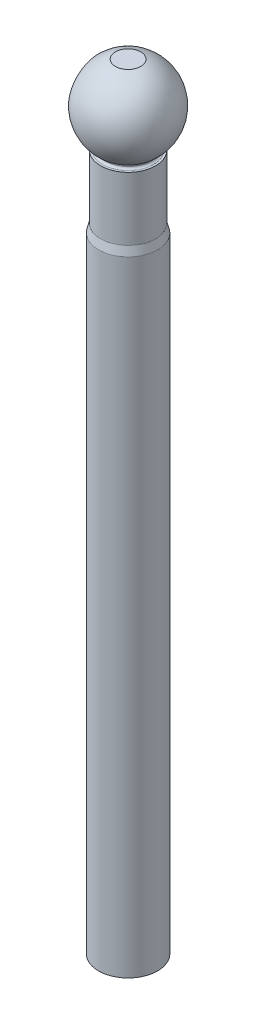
ISO-10303-21;
HEADER;
FILE_DESCRIPTION(('STEP AP214'),'2;1');
FILE_NAME('part.step','',(''),(''),'','','');
FILE_SCHEMA(('AUTOMOTIVE_DESIGN { 1 0 10303 214 1 1 1 1 }'));
ENDSEC;
DATA;
#1=APPLICATION_CONTEXT('core data for automotive mechanical design processes');
#2=APPLICATION_PROTOCOL_DEFINITION('international standard','automotive_design',2000,#1);
#3=PRODUCT_CONTEXT('',#1,'mechanical');
#4=PRODUCT('Part','Part','',(#3));
#5=PRODUCT_RELATED_PRODUCT_CATEGORY('part','',(#4));
#6=PRODUCT_DEFINITION_FORMATION('','',#4);
#7=PRODUCT_DEFINITION_CONTEXT('part definition',#1,'design');
#8=PRODUCT_DEFINITION('design','',#6,#7);
#9=PRODUCT_DEFINITION_SHAPE('','',#8);
#10=(LENGTH_UNIT() NAMED_UNIT(*) SI_UNIT(.MILLI.,.METRE.));
#11=(NAMED_UNIT(*) PLANE_ANGLE_UNIT() SI_UNIT($,.RADIAN.));
#12=(NAMED_UNIT(*) SI_UNIT($,.STERADIAN.) SOLID_ANGLE_UNIT());
#13=UNCERTAINTY_MEASURE_WITH_UNIT(LENGTH_MEASURE(1.E-05),#10,'distance_accuracy_value','');
#14=(GEOMETRIC_REPRESENTATION_CONTEXT(3) GLOBAL_UNCERTAINTY_ASSIGNED_CONTEXT((#13)) GLOBAL_UNIT_ASSIGNED_CONTEXT((#10,
#11,#12)) REPRESENTATION_CONTEXT('',''));
#15=CARTESIAN_POINT('',(0.,0.,0.));
#16=DIRECTION('',(0.,0.,1.));
#17=DIRECTION('',(1.,0.,0.));
#18=AXIS2_PLACEMENT_3D('',#15,#16,#17);
#19=CARTESIAN_POINT('',(-2.00000000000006,-3.33066907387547E-13,0.));
#20=DIRECTION('',(-1.,0.,0.));
#21=DIRECTION('',(0.,0.,1.));
#22=AXIS2_PLACEMENT_3D('',#19,#20,#21);
#23=PLANE('',#22);
#24=CARTESIAN_POINT('',(-2.00000000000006,-3.33066907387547E-13,0.));
#25=DIRECTION('',(-1.,0.,0.));
#26=DIRECTION('',(0.,0.,1.));
#27=AXIS2_PLACEMENT_3D('',#24,#25,#26);
#28=CIRCLE('',#27,6.5);
#29=CARTESIAN_POINT('',(-2.00000000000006,-3.32976701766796E-13,6.49999999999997));
#30=VERTEX_POINT('',#29);
#31=EDGE_CURVE('E72',#30,#30,#28,.T.);
#32=ORIENTED_EDGE('',*,*,#31,.T.);
#33=EDGE_LOOP('',(#32));
#34=FACE_BOUND('',#33,.T.);
#35=CARTESIAN_POINT('',(-2.00000000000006,-3.33066907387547E-13,0.));
#36=DIRECTION('',(-1.,0.,0.));
#37=DIRECTION('',(0.,0.,1.));
#38=AXIS2_PLACEMENT_3D('',#35,#36,#37);
#39=CIRCLE('',#38,6.18465843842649);
#40=CARTESIAN_POINT('',(-2.00000000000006,-3.32981078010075E-13,6.18465843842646));
#41=VERTEX_POINT('',#40);
#42=EDGE_CURVE('E35',#41,#41,#39,.F.);
#43=ORIENTED_EDGE('',*,*,#42,.T.);
#44=EDGE_LOOP('',(#43));
#45=FACE_BOUND('',#44,.T.);
#46=ADVANCED_FACE('F31',(#34,#45),#23,.T.);
#47=CARTESIAN_POINT('',(0.,0.,0.));
#48=DIRECTION('',(0.,0.999999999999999,0.));
#49=DIRECTION('',(1.,0.,0.));
#50=AXIS2_PLACEMENT_3D('',#47,#48,#49);
#51=SPHERICAL_SURFACE('',#50,10.);
#52=CARTESIAN_POINT('',(-1.66533453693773E-13,-7.59934207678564,0.));
#53=DIRECTION('',(0.,0.999999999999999,0.));
#54=DIRECTION('',(0.,0.,1.));
#55=AXIS2_PLACEMENT_3D('',#52,#53,#54);
#56=CIRCLE('',#55,6.50000000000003);
#57=CARTESIAN_POINT('',(-1.67345304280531E-13,-7.59934207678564,6.50000000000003));
#58=VERTEX_POINT('',#57);
#59=EDGE_CURVE('E54',#58,#58,#56,.T.);
#60=ORIENTED_EDGE('',*,*,#59,.T.);
#61=EDGE_LOOP('',(#60));
#62=FACE_BOUND('',#61,.T.);
#63=CARTESIAN_POINT('',(0.,9.5393920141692,0.));
#64=DIRECTION('',(0.,0.999999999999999,0.));
#65=DIRECTION('',(0.,0.,1.));
#66=AXIS2_PLACEMENT_3D('',#63,#64,#65);
#67=CIRCLE('',#66,3.00000000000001);
#68=CARTESIAN_POINT('',(0.,9.5393920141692,2.99999999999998));
#69=VERTEX_POINT('',#68);
#70=EDGE_CURVE('E57',#69,#69,#67,.T.);
#71=ORIENTED_EDGE('',*,*,#70,.F.);
#72=EDGE_LOOP('',(#71));
#73=FACE_BOUND('',#72,.T.);
#74=CARTESIAN_POINT('',(-7.00000000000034,-1.66533453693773E-13,0.));
#75=DIRECTION('',(-1.,0.,0.));
#76=DIRECTION('',(0.,0.,1.));
#77=AXIS2_PLACEMENT_3D('',#74,#75,#76);
#78=CIRCLE('',#77,7.14142842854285);
#79=CARTESIAN_POINT('',(-7.00000000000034,-1.66434346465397E-13,7.14142842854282));
#80=VERTEX_POINT('',#79);
#81=EDGE_CURVE('E69',#80,#80,#78,.F.);
#82=ORIENTED_EDGE('',*,*,#81,.T.);
#83=EDGE_LOOP('',(#82));
#84=FACE_BOUND('',#83,.T.);
#85=ADVANCED_FACE('F95',(#62,#73,#84),#51,.T.);
#86=CARTESIAN_POINT('',(0.,88.2813261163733,0.));
#87=DIRECTION('',(0.,0.999999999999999,0.));
#88=DIRECTION('',(0.,0.,1.));
#89=AXIS2_PLACEMENT_3D('',#86,#87,#88);
#90=CYLINDRICAL_SURFACE('',#89,5.50000000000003);
#91=CARTESIAN_POINT('',(0.,-8.09934207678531,0.));
#92=DIRECTION('',(0.,0.999999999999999,0.));
#93=DIRECTION('',(0.,0.,1.));
#94=AXIS2_PLACEMENT_3D('',#91,#92,#93);
#95=CIRCLE('',#94,5.50000000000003);
#96=CARTESIAN_POINT('',(0.,-8.09934207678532,5.50000000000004));
#97=VERTEX_POINT('',#96);
#98=EDGE_CURVE('E39',#97,#97,#95,.F.);
#99=CARTESIAN_POINT('',(0.,-8.59934207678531,0.));
#100=DIRECTION('',(0.,-0.999999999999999,0.));
#101=DIRECTION('',(0.,0.,-1.));
#102=AXIS2_PLACEMENT_3D('',#99,#100,#101);
#103=CIRCLE('',#102,5.50000000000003);
#104=CARTESIAN_POINT('',(0.,-8.59934207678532,5.50000000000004));
#105=VERTEX_POINT('',#104);
#106=EDGE_CURVE('E43',#105,#105,#103,.F.);
#107=CARTESIAN_POINT('',(0.,-8.09934207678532,5.50000000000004));
#108=CARTESIAN_POINT('',(0.,-8.10455041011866,5.50000000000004));
#109=CARTESIAN_POINT('',(0.,-8.10975874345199,5.50000000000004));
#110=CARTESIAN_POINT('',(0.,-8.12017541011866,5.50000000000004));
#111=CARTESIAN_POINT('',(0.,-8.12538374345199,5.50000000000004));
#112=CARTESIAN_POINT('',(0.,-8.13580041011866,5.50000000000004));
#113=CARTESIAN_POINT('',(0.,-8.14100874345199,5.50000000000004));
#114=CARTESIAN_POINT('',(0.,-8.15142541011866,5.50000000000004));
#115=CARTESIAN_POINT('',(0.,-8.15663374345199,5.50000000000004));
#116=CARTESIAN_POINT('',(0.,-8.16705041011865,5.50000000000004));
#117=CARTESIAN_POINT('',(0.,-8.17225874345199,5.50000000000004));
#118=CARTESIAN_POINT('',(0.,-8.18267541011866,5.50000000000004));
#119=CARTESIAN_POINT('',(0.,-8.18788374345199,5.50000000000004));
#120=CARTESIAN_POINT('',(0.,-8.19830041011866,5.50000000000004));
#121=CARTESIAN_POINT('',(0.,-8.20350874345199,5.50000000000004));
#122=CARTESIAN_POINT('',(0.,-8.21392541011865,5.50000000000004));
#123=CARTESIAN_POINT('',(0.,-8.21913374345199,5.50000000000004));
#124=CARTESIAN_POINT('',(0.,-8.22955041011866,5.50000000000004));
#125=CARTESIAN_POINT('',(0.,-8.23475874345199,5.50000000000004));
#126=CARTESIAN_POINT('',(0.,-8.24517541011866,5.50000000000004));
#127=CARTESIAN_POINT('',(0.,-8.25038374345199,5.50000000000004));
#128=CARTESIAN_POINT('',(0.,-8.26080041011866,5.50000000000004));
#129=CARTESIAN_POINT('',(0.,-8.26600874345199,5.50000000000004));
#130=CARTESIAN_POINT('',(0.,-8.27642541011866,5.50000000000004));
#131=CARTESIAN_POINT('',(0.,-8.281633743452,5.50000000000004));
#132=CARTESIAN_POINT('',(0.,-8.29205041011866,5.50000000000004));
#133=CARTESIAN_POINT('',(0.,-8.29725874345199,5.50000000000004));
#134=CARTESIAN_POINT('',(0.,-8.30767541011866,5.50000000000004));
#135=CARTESIAN_POINT('',(0.,-8.31288374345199,5.50000000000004));
#136=CARTESIAN_POINT('',(0.,-8.32330041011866,5.50000000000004));
#137=CARTESIAN_POINT('',(0.,-8.32850874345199,5.50000000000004));
#138=CARTESIAN_POINT('',(0.,-8.33892541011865,5.50000000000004));
#139=CARTESIAN_POINT('',(0.,-8.34413374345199,5.50000000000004));
#140=CARTESIAN_POINT('',(0.,-8.35455041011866,5.50000000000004));
#141=CARTESIAN_POINT('',(0.,-8.35975874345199,5.50000000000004));
#142=CARTESIAN_POINT('',(0.,-8.37017541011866,5.50000000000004));
#143=CARTESIAN_POINT('',(0.,-8.37538374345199,5.50000000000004));
#144=CARTESIAN_POINT('',(0.,-8.38580041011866,5.50000000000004));
#145=CARTESIAN_POINT('',(0.,-8.39100874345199,5.50000000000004));
#146=CARTESIAN_POINT('',(0.,-8.40142541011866,5.50000000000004));
#147=CARTESIAN_POINT('',(0.,-8.40663374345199,5.50000000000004));
#148=CARTESIAN_POINT('',(0.,-8.41705041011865,5.50000000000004));
#149=CARTESIAN_POINT('',(0.,-8.42225874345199,5.50000000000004));
#150=CARTESIAN_POINT('',(0.,-8.43267541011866,5.50000000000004));
#151=CARTESIAN_POINT('',(0.,-8.43788374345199,5.50000000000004));
#152=CARTESIAN_POINT('',(0.,-8.44830041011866,5.50000000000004));
#153=CARTESIAN_POINT('',(0.,-8.45350874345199,5.50000000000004));
#154=CARTESIAN_POINT('',(0.,-8.46392541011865,5.50000000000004));
#155=CARTESIAN_POINT('',(0.,-8.46913374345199,5.50000000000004));
#156=CARTESIAN_POINT('',(0.,-8.47955041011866,5.50000000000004));
#157=CARTESIAN_POINT('',(0.,-8.48475874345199,5.50000000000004));
#158=CARTESIAN_POINT('',(0.,-8.49517541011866,5.50000000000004));
#159=CARTESIAN_POINT('',(0.,-8.50038374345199,5.50000000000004));
#160=CARTESIAN_POINT('',(0.,-8.51080041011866,5.50000000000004));
#161=CARTESIAN_POINT('',(0.,-8.51600874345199,5.50000000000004));
#162=CARTESIAN_POINT('',(0.,-8.52642541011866,5.50000000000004));
#163=CARTESIAN_POINT('',(0.,-8.531633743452,5.50000000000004));
#164=CARTESIAN_POINT('',(0.,-8.54205041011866,5.50000000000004));
#165=CARTESIAN_POINT('',(0.,-8.54725874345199,5.50000000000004));
#166=CARTESIAN_POINT('',(0.,-8.55767541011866,5.50000000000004));
#167=CARTESIAN_POINT('',(0.,-8.56288374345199,5.50000000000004));
#168=CARTESIAN_POINT('',(0.,-8.57330041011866,5.50000000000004));
#169=CARTESIAN_POINT('',(0.,-8.57850874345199,5.50000000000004));
#170=CARTESIAN_POINT('',(0.,-8.58892541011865,5.50000000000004));
#171=CARTESIAN_POINT('',(0.,-8.59413374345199,5.50000000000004));
#172=CARTESIAN_POINT('',(0.,-8.59934207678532,5.50000000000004));
#173=B_SPLINE_CURVE_WITH_KNOTS('',3,(#107,#108,#109,#110,#111,#112,#113,#114,#115,#116,#117,
#118,#119,#120,#121,#122,#123,#124,#125,#126,#127,#128,#129,#130,#131,#132,#133,#134,#135,#136,
#137,#138,#139,#140,#141,#142,#143,#144,#145,#146,#147,#148,#149,#150,#151,#152,#153,#154,#155,
#156,#157,#158,#159,#160,#161,#162,#163,#164,#165,#166,#167,#168,#169,#170,#171,#172),
.UNSPECIFIED.,.F.,.F.,(4,2,2,2,2,2,2,2,2,2,2,2,2,2,2,2,2,2,2,2,2,2,2,2,2,2,2,2,2,2,2,2,4),(0.,
0.0156250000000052,0.0312499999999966,0.0468750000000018,0.0624999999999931,0.0781249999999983,
0.0937500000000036,0.109374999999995,0.125,0.140625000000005,0.156249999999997,
0.171875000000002,0.187500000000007,0.203124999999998,0.218750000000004,0.234374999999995,0.25,
0.265625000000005,0.281249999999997,0.296875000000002,0.312499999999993,0.328124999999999,
0.343750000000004,0.359374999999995,0.375,0.390625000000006,0.406249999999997,0.421875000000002,
0.437500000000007,0.453124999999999,0.468750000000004,0.484374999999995,0.5),.UNSPECIFIED.);
#174=EDGE_CURVE('BSEAM33',#97,#105,#173,.T.);
#175=ORIENTED_EDGE('',*,*,#98,.T.);
#176=ORIENTED_EDGE('',*,*,#106,.T.);
#177=ORIENTED_EDGE('',*,*,#174,.T.);
#178=ORIENTED_EDGE('',*,*,#174,.F.);
#179=EDGE_LOOP('',(#175,#177,#176,#178));
#180=FACE_BOUND('',#179,.T.);
#181=ADVANCED_FACE('F33',(#180),#90,.T.);
#182=CARTESIAN_POINT('',(6.49999999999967,-7.5993420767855,0.));
#183=DIRECTION('',(0.,0.999999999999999,0.));
#184=DIRECTION('',(0.,0.,1.));
#185=AXIS2_PLACEMENT_3D('',#182,#183,#184);
#186=PLANE('',#185);
#187=CARTESIAN_POINT('',(-1.66533453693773E-13,-7.59934207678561,0.));
#188=DIRECTION('',(0.,0.999999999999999,0.));
#189=DIRECTION('',(0.,0.,1.));
#190=AXIS2_PLACEMENT_3D('',#187,#188,#189);
#191=CIRCLE('',#190,6.00000000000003);
#192=CARTESIAN_POINT('',(-1.67282854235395E-13,-7.59934207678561,6.00000000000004));
#193=VERTEX_POINT('',#192);
#194=EDGE_CURVE('E48',#193,#193,#191,.T.);
#195=ORIENTED_EDGE('',*,*,#194,.T.);
#196=EDGE_LOOP('',(#195));
#197=FACE_BOUND('',#196,.T.);
#198=ORIENTED_EDGE('',*,*,#59,.F.);
#199=EDGE_LOOP('',(#198));
#200=FACE_BOUND('',#199,.T.);
#201=ADVANCED_FACE('F135',(#197,#200),#186,.F.);
#202=CARTESIAN_POINT('',(0.,9.5393920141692,0.));
#203=DIRECTION('',(0.,-0.999999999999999,0.));
#204=DIRECTION('',(0.,0.,-1.));
#205=AXIS2_PLACEMENT_3D('',#202,#203,#204);
#206=PLANE('',#205);
#207=ORIENTED_EDGE('',*,*,#70,.T.);
#208=EDGE_LOOP('',(#207));
#209=FACE_BOUND('',#208,.T.);
#210=ADVANCED_FACE('F132',(#209),#206,.F.);
#211=CARTESIAN_POINT('',(6.99999999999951,-174.099342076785,0.));
#212=DIRECTION('',(0.,0.999999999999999,0.));
#213=DIRECTION('',(0.,0.,1.));
#214=AXIS2_PLACEMENT_3D('',#211,#212,#213);
#215=PLANE('',#214);
#216=CARTESIAN_POINT('',(0.,-174.099342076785,0.));
#217=DIRECTION('',(0.,0.999999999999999,0.));
#218=DIRECTION('',(0.,0.,1.));
#219=AXIS2_PLACEMENT_3D('',#216,#217,#218);
#220=CIRCLE('',#219,7.00000000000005);
#221=CARTESIAN_POINT('',(0.,-174.099342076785,7.00000000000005));
#222=VERTEX_POINT('',#221);
#223=EDGE_CURVE('E60',#222,#222,#220,.T.);
#224=ORIENTED_EDGE('',*,*,#223,.F.);
#225=EDGE_LOOP('',(#224));
#226=FACE_BOUND('',#225,.T.);
#227=ADVANCED_FACE('F128',(#226),#215,.F.);
#228=CARTESIAN_POINT('',(0.,88.2813261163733,0.));
#229=DIRECTION('',(0.,0.999999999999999,0.));
#230=DIRECTION('',(0.,0.,1.));
#231=AXIS2_PLACEMENT_3D('',#228,#229,#230);
#232=CYLINDRICAL_SURFACE('',#231,7.00000000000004);
#233=CARTESIAN_POINT('',(-1.66533453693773E-13,-26.0993420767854,0.));
#234=DIRECTION('',(0.,-0.999999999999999,0.));
#235=DIRECTION('',(0.,0.,-1.));
#236=AXIS2_PLACEMENT_3D('',#233,#234,#235);
#237=CIRCLE('',#236,7.00000000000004);
#238=CARTESIAN_POINT('',(0.,-26.0993420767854,7.00000000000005));
#239=VERTEX_POINT('',#238);
#240=EDGE_CURVE('E51',#239,#239,#237,.T.);
#241=CARTESIAN_POINT('',(0.,-26.0993420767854,7.00000000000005));
#242=CARTESIAN_POINT('',(0.,-27.6410087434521,7.00000000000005));
#243=CARTESIAN_POINT('',(0.,-29.1826754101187,7.00000000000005));
#244=CARTESIAN_POINT('',(0.,-32.2660087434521,7.00000000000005));
#245=CARTESIAN_POINT('',(0.,-33.8076754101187,7.00000000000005));
#246=CARTESIAN_POINT('',(0.,-36.8910087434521,7.00000000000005));
#247=CARTESIAN_POINT('',(0.,-38.4326754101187,7.00000000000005));
#248=CARTESIAN_POINT('',(0.,-41.516008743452,7.00000000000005));
#249=CARTESIAN_POINT('',(0.,-43.0576754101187,7.00000000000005));
#250=CARTESIAN_POINT('',(0.,-46.1410087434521,7.00000000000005));
#251=CARTESIAN_POINT('',(0.,-47.6826754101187,7.00000000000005));
#252=CARTESIAN_POINT('',(0.,-50.7660087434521,7.00000000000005));
#253=CARTESIAN_POINT('',(0.,-52.3076754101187,7.00000000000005));
#254=CARTESIAN_POINT('',(0.,-55.3910087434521,7.00000000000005));
#255=CARTESIAN_POINT('',(0.,-56.9326754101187,7.00000000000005));
#256=CARTESIAN_POINT('',(0.,-60.0160087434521,7.00000000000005));
#257=CARTESIAN_POINT('',(0.,-61.5576754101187,7.00000000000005));
#258=CARTESIAN_POINT('',(0.,-64.6410087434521,7.00000000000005));
#259=CARTESIAN_POINT('',(0.,-66.1826754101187,7.00000000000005));
#260=CARTESIAN_POINT('',(0.,-69.2660087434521,7.00000000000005));
#261=CARTESIAN_POINT('',(0.,-70.8076754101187,7.00000000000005));
#262=CARTESIAN_POINT('',(0.,-73.8910087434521,7.00000000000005));
#263=CARTESIAN_POINT('',(0.,-75.4326754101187,7.00000000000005));
#264=CARTESIAN_POINT('',(0.,-78.516008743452,7.00000000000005));
#265=CARTESIAN_POINT('',(0.,-80.0576754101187,7.00000000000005));
#266=CARTESIAN_POINT('',(0.,-83.141008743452,7.00000000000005));
#267=CARTESIAN_POINT('',(0.,-84.6826754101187,7.00000000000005));
#268=CARTESIAN_POINT('',(0.,-87.766008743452,7.00000000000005));
#269=CARTESIAN_POINT('',(0.,-89.3076754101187,7.00000000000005));
#270=CARTESIAN_POINT('',(0.,-92.391008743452,7.00000000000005));
#271=CARTESIAN_POINT('',(0.,-93.9326754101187,7.00000000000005));
#272=CARTESIAN_POINT('',(0.,-97.016008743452,7.00000000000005));
#273=CARTESIAN_POINT('',(0.,-98.5576754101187,7.00000000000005));
#274=CARTESIAN_POINT('',(0.,-101.641008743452,7.00000000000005));
#275=CARTESIAN_POINT('',(0.,-103.182675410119,7.00000000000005));
#276=CARTESIAN_POINT('',(0.,-106.266008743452,7.00000000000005));
#277=CARTESIAN_POINT('',(0.,-107.807675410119,7.00000000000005));
#278=CARTESIAN_POINT('',(0.,-110.891008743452,7.00000000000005));
#279=CARTESIAN_POINT('',(0.,-112.432675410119,7.00000000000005));
#280=CARTESIAN_POINT('',(0.,-115.516008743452,7.00000000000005));
#281=CARTESIAN_POINT('',(0.,-117.057675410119,7.00000000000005));
#282=CARTESIAN_POINT('',(0.,-120.141008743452,7.00000000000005));
#283=CARTESIAN_POINT('',(0.,-121.682675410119,7.00000000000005));
#284=CARTESIAN_POINT('',(0.,-124.766008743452,7.00000000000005));
#285=CARTESIAN_POINT('',(0.,-126.307675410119,7.00000000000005));
#286=CARTESIAN_POINT('',(0.,-129.391008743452,7.00000000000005));
#287=CARTESIAN_POINT('',(0.,-130.932675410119,7.00000000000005));
#288=CARTESIAN_POINT('',(0.,-134.016008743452,7.00000000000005));
#289=CARTESIAN_POINT('',(0.,-135.557675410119,7.00000000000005));
#290=CARTESIAN_POINT('',(0.,-138.641008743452,7.00000000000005));
#291=CARTESIAN_POINT('',(0.,-140.182675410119,7.00000000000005));
#292=CARTESIAN_POINT('',(0.,-143.266008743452,7.00000000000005));
#293=CARTESIAN_POINT('',(0.,-144.807675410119,7.00000000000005));
#294=CARTESIAN_POINT('',(0.,-147.891008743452,7.00000000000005));
#295=CARTESIAN_POINT('',(0.,-149.432675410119,7.00000000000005));
#296=CARTESIAN_POINT('',(0.,-152.516008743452,7.00000000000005));
#297=CARTESIAN_POINT('',(0.,-154.057675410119,7.00000000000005));
#298=CARTESIAN_POINT('',(0.,-157.141008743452,7.00000000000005));
#299=CARTESIAN_POINT('',(0.,-158.682675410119,7.00000000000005));
#300=CARTESIAN_POINT('',(0.,-161.766008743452,7.00000000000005));
#301=CARTESIAN_POINT('',(0.,-163.307675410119,7.00000000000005));
#302=CARTESIAN_POINT('',(0.,-166.391008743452,7.00000000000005));
#303=CARTESIAN_POINT('',(0.,-167.932675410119,7.00000000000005));
#304=CARTESIAN_POINT('',(0.,-171.016008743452,7.00000000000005));
#305=CARTESIAN_POINT('',(0.,-172.557675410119,7.00000000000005));
#306=CARTESIAN_POINT('',(0.,-174.099342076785,7.00000000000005));
#307=B_SPLINE_CURVE_WITH_KNOTS('',3,(#241,#242,#243,#244,#245,#246,#247,#248,#249,#250,#251,
#252,#253,#254,#255,#256,#257,#258,#259,#260,#261,#262,#263,#264,#265,#266,#267,#268,#269,#270,
#271,#272,#273,#274,#275,#276,#277,#278,#279,#280,#281,#282,#283,#284,#285,#286,#287,#288,#289,
#290,#291,#292,#293,#294,#295,#296,#297,#298,#299,#300,#301,#302,#303,#304,#305,#306),
.UNSPECIFIED.,.F.,.F.,(4,2,2,2,2,2,2,2,2,2,2,2,2,2,2,2,2,2,2,2,2,2,2,2,2,2,2,2,2,2,2,2,4),(0.,
4.62499999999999,9.24999999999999,13.875,18.5,23.125,27.75,32.375,37.,41.625,46.25,50.875,55.5,
60.125,64.7499999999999,69.375,74.,78.625,83.2499999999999,87.8749999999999,92.4999999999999,
97.125,101.75,106.375,111.,115.625,120.25,124.875,129.5,134.125,138.75,143.375,148.),.UNSPECIFIED.);
#308=EDGE_CURVE('BSEAM124',#239,#222,#307,.T.);
#309=ORIENTED_EDGE('',*,*,#240,.T.);
#310=ORIENTED_EDGE('',*,*,#223,.T.);
#311=ORIENTED_EDGE('',*,*,#308,.T.);
#312=ORIENTED_EDGE('',*,*,#308,.F.);
#313=EDGE_LOOP('',(#309,#311,#310,#312));
#314=FACE_BOUND('',#313,.T.);
#315=ADVANCED_FACE('F124',(#314),#232,.T.);
#316=CARTESIAN_POINT('',(0.,88.2813261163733,0.));
#317=DIRECTION('',(0.,0.999999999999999,0.));
#318=DIRECTION('',(0.,0.,1.));
#319=AXIS2_PLACEMENT_3D('',#316,#317,#318);
#320=CYLINDRICAL_SURFACE('',#319,6.50000000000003);
#321=CARTESIAN_POINT('',(-6.66133814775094E-13,-9.0993420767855,0.));
#322=DIRECTION('',(0.,0.999999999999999,0.));
#323=DIRECTION('',(0.,0.,1.));
#324=AXIS2_PLACEMENT_3D('',#321,#322,#323);
#325=CIRCLE('',#324,6.50000000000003);
#326=CARTESIAN_POINT('',(0.,-9.09934207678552,6.50000000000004));
#327=VERTEX_POINT('',#326);
#328=EDGE_CURVE('E66',#327,#327,#325,.T.);
#329=CARTESIAN_POINT('',(0.,-24.0993420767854,0.));
#330=DIRECTION('',(0.,0.999999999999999,0.));
#331=DIRECTION('',(0.,0.,1.));
#332=AXIS2_PLACEMENT_3D('',#329,#330,#331);
#333=CIRCLE('',#332,6.50000000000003);
#334=CARTESIAN_POINT('',(0.,-24.0993420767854,6.50000000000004));
#335=VERTEX_POINT('',#334);
#336=EDGE_CURVE('E63',#335,#335,#333,.T.);
#337=CARTESIAN_POINT('',(0.,-9.09934207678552,6.50000000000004));
#338=CARTESIAN_POINT('',(0.,-9.25559207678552,6.50000000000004));
#339=CARTESIAN_POINT('',(0.,-9.41184207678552,6.50000000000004));
#340=CARTESIAN_POINT('',(0.,-9.72434207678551,6.50000000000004));
#341=CARTESIAN_POINT('',(0.,-9.88059207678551,6.50000000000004));
#342=CARTESIAN_POINT('',(0.,-10.1930920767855,6.50000000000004));
#343=CARTESIAN_POINT('',(0.,-10.3493420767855,6.50000000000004));
#344=CARTESIAN_POINT('',(0.,-10.6618420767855,6.50000000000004));
#345=CARTESIAN_POINT('',(0.,-10.8180920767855,6.50000000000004));
#346=CARTESIAN_POINT('',(0.,-11.1305920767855,6.50000000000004));
#347=CARTESIAN_POINT('',(0.,-11.2868420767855,6.50000000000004));
#348=CARTESIAN_POINT('',(0.,-11.5993420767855,6.50000000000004));
#349=CARTESIAN_POINT('',(0.,-11.7555920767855,6.50000000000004));
#350=CARTESIAN_POINT('',(0.,-12.0680920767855,6.50000000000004));
#351=CARTESIAN_POINT('',(0.,-12.2243420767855,6.50000000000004));
#352=CARTESIAN_POINT('',(0.,-12.5368420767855,6.50000000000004));
#353=CARTESIAN_POINT('',(0.,-12.6930920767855,6.50000000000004));
#354=CARTESIAN_POINT('',(0.,-13.0055920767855,6.50000000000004));
#355=CARTESIAN_POINT('',(0.,-13.1618420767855,6.50000000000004));
#356=CARTESIAN_POINT('',(0.,-13.4743420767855,6.50000000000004));
#357=CARTESIAN_POINT('',(0.,-13.6305920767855,6.50000000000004));
#358=CARTESIAN_POINT('',(0.,-13.9430920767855,6.50000000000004));
#359=CARTESIAN_POINT('',(0.,-14.0993420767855,6.50000000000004));
#360=CARTESIAN_POINT('',(0.,-14.4118420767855,6.50000000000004));
#361=CARTESIAN_POINT('',(0.,-14.5680920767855,6.50000000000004));
#362=CARTESIAN_POINT('',(0.,-14.8805920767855,6.50000000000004));
#363=CARTESIAN_POINT('',(0.,-15.0368420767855,6.50000000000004));
#364=CARTESIAN_POINT('',(0.,-15.3493420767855,6.50000000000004));
#365=CARTESIAN_POINT('',(0.,-15.5055920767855,6.50000000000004));
#366=CARTESIAN_POINT('',(0.,-15.8180920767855,6.50000000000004));
#367=CARTESIAN_POINT('',(0.,-15.9743420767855,6.50000000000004));
#368=CARTESIAN_POINT('',(0.,-16.2868420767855,6.50000000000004));
#369=CARTESIAN_POINT('',(0.,-16.4430920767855,6.50000000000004));
#370=CARTESIAN_POINT('',(0.,-16.7555920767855,6.50000000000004));
#371=CARTESIAN_POINT('',(0.,-16.9118420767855,6.50000000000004));
#372=CARTESIAN_POINT('',(0.,-17.2243420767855,6.50000000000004));
#373=CARTESIAN_POINT('',(0.,-17.3805920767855,6.50000000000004));
#374=CARTESIAN_POINT('',(0.,-17.6930920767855,6.50000000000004));
#375=CARTESIAN_POINT('',(0.,-17.8493420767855,6.50000000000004));
#376=CARTESIAN_POINT('',(0.,-18.1618420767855,6.50000000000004));
#377=CARTESIAN_POINT('',(0.,-18.3180920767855,6.50000000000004));
#378=CARTESIAN_POINT('',(0.,-18.6305920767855,6.50000000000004));
#379=CARTESIAN_POINT('',(0.,-18.7868420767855,6.50000000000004));
#380=CARTESIAN_POINT('',(0.,-19.0993420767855,6.50000000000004));
#381=CARTESIAN_POINT('',(0.,-19.2555920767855,6.50000000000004));
#382=CARTESIAN_POINT('',(0.,-19.5680920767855,6.50000000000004));
#383=CARTESIAN_POINT('',(0.,-19.7243420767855,6.50000000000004));
#384=CARTESIAN_POINT('',(0.,-20.0368420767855,6.50000000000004));
#385=CARTESIAN_POINT('',(0.,-20.1930920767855,6.50000000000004));
#386=CARTESIAN_POINT('',(0.,-20.5055920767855,6.50000000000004));
#387=CARTESIAN_POINT('',(0.,-20.6618420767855,6.50000000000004));
#388=CARTESIAN_POINT('',(0.,-20.9743420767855,6.50000000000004));
#389=CARTESIAN_POINT('',(0.,-21.1305920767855,6.50000000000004));
#390=CARTESIAN_POINT('',(0.,-21.4430920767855,6.50000000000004));
#391=CARTESIAN_POINT('',(0.,-21.5993420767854,6.50000000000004));
#392=CARTESIAN_POINT('',(0.,-21.9118420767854,6.50000000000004));
#393=CARTESIAN_POINT('',(0.,-22.0680920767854,6.50000000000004));
#394=CARTESIAN_POINT('',(0.,-22.3805920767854,6.50000000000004));
#395=CARTESIAN_POINT('',(0.,-22.5368420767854,6.50000000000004));
#396=CARTESIAN_POINT('',(0.,-22.8493420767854,6.50000000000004));
#397=CARTESIAN_POINT('',(0.,-23.0055920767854,6.50000000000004));
#398=CARTESIAN_POINT('',(0.,-23.3180920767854,6.50000000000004));
#399=CARTESIAN_POINT('',(0.,-23.4743420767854,6.50000000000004));
#400=CARTESIAN_POINT('',(0.,-23.7868420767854,6.50000000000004));
#401=CARTESIAN_POINT('',(0.,-23.9430920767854,6.50000000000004));
#402=CARTESIAN_POINT('',(0.,-24.0993420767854,6.50000000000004));
#403=B_SPLINE_CURVE_WITH_KNOTS('',3,(#337,#338,#339,#340,#341,#342,#343,#344,#345,#346,#347,
#348,#349,#350,#351,#352,#353,#354,#355,#356,#357,#358,#359,#360,#361,#362,#363,#364,#365,#366,
#367,#368,#369,#370,#371,#372,#373,#374,#375,#376,#377,#378,#379,#380,#381,#382,#383,#384,#385,
#386,#387,#388,#389,#390,#391,#392,#393,#394,#395,#396,#397,#398,#399,#400,#401,#402),
.UNSPECIFIED.,.F.,.F.,(4,2,2,2,2,2,2,2,2,2,2,2,2,2,2,2,2,2,2,2,2,2,2,2,2,2,2,2,2,2,2,2,4),(0.,
0.468750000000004,0.93749999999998,1.40624999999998,1.87499999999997,2.34374999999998,
2.81249999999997,3.28124999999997,3.74999999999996,4.21874999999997,4.68749999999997,
5.15624999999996,5.62499999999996,6.09374999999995,6.56249999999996,7.03124999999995,
7.49999999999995,7.96874999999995,8.43749999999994,8.90624999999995,9.37499999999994,
9.84374999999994,10.3124999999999,10.7812499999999,11.2499999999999,11.7187499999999,
12.1874999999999,12.6562499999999,13.1249999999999,13.5937499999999,14.0624999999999,
14.5312499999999,14.9999999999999),.UNSPECIFIED.);
#404=EDGE_CURVE('BSEAM121',#327,#335,#403,.T.);
#405=ORIENTED_EDGE('',*,*,#328,.F.);
#406=ORIENTED_EDGE('',*,*,#336,.T.);
#407=ORIENTED_EDGE('',*,*,#404,.T.);
#408=ORIENTED_EDGE('',*,*,#404,.F.);
#409=EDGE_LOOP('',(#405,#407,#406,#408));
#410=FACE_BOUND('',#409,.T.);
#411=ADVANCED_FACE('F121',(#410),#320,.T.);
#412=CARTESIAN_POINT('',(6.49999999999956,-9.09934207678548,0.));
#413=DIRECTION('',(0.,-0.999999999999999,0.));
#414=DIRECTION('',(0.,0.,-1.));
#415=AXIS2_PLACEMENT_3D('',#412,#413,#414);
#416=PLANE('',#415);
#417=CARTESIAN_POINT('',(-6.66133814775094E-13,-9.0993420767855,0.));
#418=DIRECTION('',(0.,-0.999999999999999,0.));
#419=DIRECTION('',(0.,0.,-1.));
#420=AXIS2_PLACEMENT_3D('',#417,#418,#419);
#421=CIRCLE('',#420,6.00000000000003);
#422=CARTESIAN_POINT('',(-6.65384414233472E-13,-9.0993420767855,-6.00000000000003));
#423=VERTEX_POINT('',#422);
#424=EDGE_CURVE('E10',#423,#423,#421,.T.);
#425=ORIENTED_EDGE('',*,*,#424,.T.);
#426=EDGE_LOOP('',(#425));
#427=FACE_BOUND('',#426,.T.);
#428=ORIENTED_EDGE('',*,*,#328,.T.);
#429=EDGE_LOOP('',(#428));
#430=FACE_BOUND('',#429,.T.);
#431=ADVANCED_FACE('F117',(#427,#430),#416,.F.);
#432=CARTESIAN_POINT('',(0.,-24.0993420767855,0.));
#433=DIRECTION('',(0.,-0.999999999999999,0.));
#434=DIRECTION('',(0.,0.,-1.));
#435=AXIS2_PLACEMENT_3D('',#432,#433,#434);
#436=CONICAL_SURFACE('',#435,6.50000000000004,0.244978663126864);
#437=ORIENTED_EDGE('',*,*,#240,.F.);
#438=EDGE_LOOP('',(#437));
#439=FACE_BOUND('',#438,.T.);
#440=ORIENTED_EDGE('',*,*,#336,.F.);
#441=EDGE_LOOP('',(#440));
#442=FACE_BOUND('',#441,.T.);
#443=ADVANCED_FACE('F113',(#439,#442),#436,.T.);
#444=CARTESIAN_POINT('',(0.,-8.09934207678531,0.));
#445=DIRECTION('',(0.,0.999999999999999,0.));
#446=DIRECTION('',(0.,0.,1.));
#447=AXIS2_PLACEMENT_3D('',#444,#445,#446);
#448=TOROIDAL_SURFACE('',#447,6.00000000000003,0.5);
#449=ORIENTED_EDGE('',*,*,#98,.F.);
#450=EDGE_LOOP('',(#449));
#451=FACE_BOUND('',#450,.T.);
#452=ORIENTED_EDGE('',*,*,#194,.F.);
#453=EDGE_LOOP('',(#452));
#454=FACE_BOUND('',#453,.T.);
#455=ADVANCED_FACE('F109',(#451,#454),#448,.F.);
#456=CARTESIAN_POINT('',(0.,-8.59934207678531,0.));
#457=DIRECTION('',(0.,-0.999999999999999,0.));
#458=DIRECTION('',(0.,0.,-1.));
#459=AXIS2_PLACEMENT_3D('',#456,#457,#458);
#460=TOROIDAL_SURFACE('',#459,6.00000000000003,0.5);
#461=ORIENTED_EDGE('',*,*,#424,.F.);
#462=EDGE_LOOP('',(#461));
#463=FACE_BOUND('',#462,.T.);
#464=ORIENTED_EDGE('',*,*,#106,.F.);
#465=EDGE_LOOP('',(#464));
#466=FACE_BOUND('',#465,.T.);
#467=ADVANCED_FACE('F105',(#463,#466),#460,.F.);
#468=CARTESIAN_POINT('',(-7.00000000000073,9.54039201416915,-9.86494733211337));
#469=DIRECTION('',(-1.,0.,0.));
#470=DIRECTION('',(0.,0.,1.));
#471=AXIS2_PLACEMENT_3D('',#468,#469,#470);
#472=PLANE('',#471);
#473=CARTESIAN_POINT('',(-7.00000000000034,-1.66533453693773E-13,0.));
#474=DIRECTION('',(-1.,0.,0.));
#475=DIRECTION('',(0.,0.,1.));
#476=AXIS2_PLACEMENT_3D('',#473,#474,#475);
#477=CIRCLE('',#476,6.5);
#478=CARTESIAN_POINT('',(-7.00000000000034,-1.66443248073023E-13,6.49999999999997));
#479=VERTEX_POINT('',#478);
#480=EDGE_CURVE('E75',#479,#479,#477,.T.);
#481=ORIENTED_EDGE('',*,*,#480,.F.);
#482=EDGE_LOOP('',(#481));
#483=FACE_BOUND('',#482,.T.);
#484=ORIENTED_EDGE('',*,*,#81,.F.);
#485=EDGE_LOOP('',(#484));
#486=FACE_BOUND('',#485,.T.);
#487=ADVANCED_FACE('F90',(#483,#486),#472,.T.);
#488=CARTESIAN_POINT('',(-2.00000000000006,-3.33066907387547E-13,0.));
#489=DIRECTION('',(-1.,0.,0.));
#490=DIRECTION('',(0.,0.,1.));
#491=AXIS2_PLACEMENT_3D('',#488,#489,#490);
#492=CYLINDRICAL_SURFACE('',#491,6.5);
#493=ORIENTED_EDGE('',*,*,#31,.F.);
#494=EDGE_LOOP('',(#493));
#495=FACE_BOUND('',#494,.T.);
#496=ORIENTED_EDGE('',*,*,#480,.T.);
#497=EDGE_LOOP('',(#496));
#498=FACE_BOUND('',#497,.T.);
#499=ADVANCED_FACE('F85',(#495,#498),#492,.F.);
#500=CARTESIAN_POINT('',(0.,0.,0.));
#501=DIRECTION('',(-1.,0.,0.));
#502=DIRECTION('',(0.,0.,-1.));
#503=AXIS2_PLACEMENT_3D('',#500,#501,#502);
#504=SPHERICAL_SURFACE('',#503,6.5);
#505=ORIENTED_EDGE('',*,*,#42,.F.);
#506=EDGE_LOOP('',(#505));
#507=FACE_BOUND('',#506,.T.);
#508=ADVANCED_FACE('F83',(#507),#504,.F.);
#509=CLOSED_SHELL('',(#46,#85,#181,#201,#210,#227,#315,#411,#431,#443,#455,#467,#487,#499,#508));
#510=MANIFOLD_SOLID_BREP('B2',#509);
#511=ADVANCED_BREP_SHAPE_REPRESENTATION('',(#18,#510),#14);
#512=SHAPE_DEFINITION_REPRESENTATION(#9,#511);
ENDSEC;
END-ISO-10303-21;
